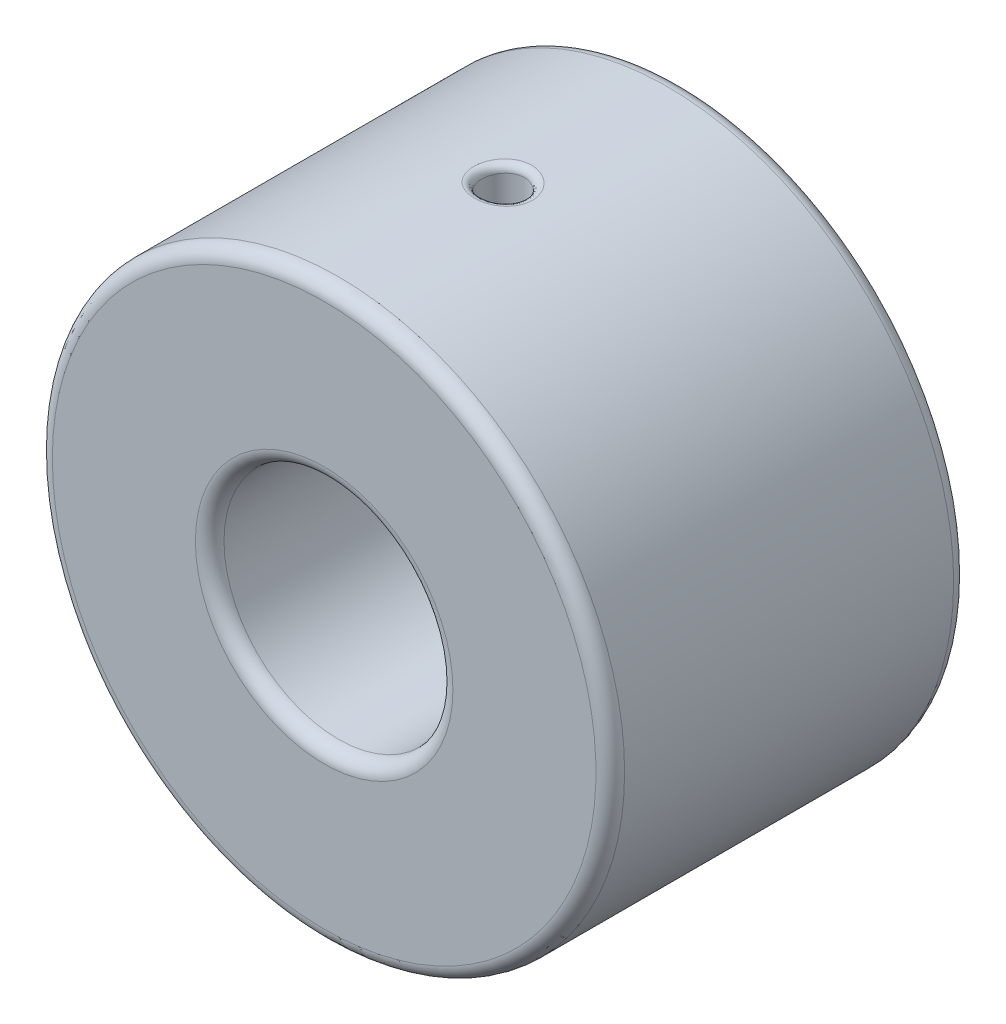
from build123d import *

# Parameters (mm, degrees)
SKETCH_1_W          = 12.5
SKETCH_1_H          = 6
FILLET_1_R          = 0.5
SKETCH_2_R          = 0.75
CUT_EXTRUDE_1_DEPTH = 10
FILLET_2_R          = 0.25


with BuildPart() as part:
    # Sketch 1 → Revolve 1 (revolve)
    with BuildSketch(Plane(origin=(0, 0, 0), x_dir=(0, 0, -1), z_dir=(1, 0, 0)), mode=Mode.PRIVATE) as revolve_1_sk:
        with Locations((0, 7)):
            Rectangle(SKETCH_1_W, SKETCH_1_H)
    revolve(revolve_1_sk.sketch.rotate(Axis((0, 0, 6.25), (0, 0, -1)), 90), axis=Axis((0, 0, 6.25), (0, 0, -1)))

    # Fillet 1
    fillet_1_edges = [part.edges().sort_by_distance(p)[0] for p in [
        (-10, 0, 6.25),
        (-10, 0, -6.25),
        (-4, 0, -6.25),
        (-4, 0, 6.25),
    ]]
    fillet(fillet_1_edges, radius=FILLET_1_R)

    # Sketch 2 → Cut-Extrude 1 (cut, symmetric)
    with BuildSketch(Plane(origin=(0, 0, 0), x_dir=(1, 0, 0), z_dir=(0, 1, 0))):
        with Locations(Location((0, 0, 0), (0, 0, 270))):
            Circle(SKETCH_2_R)
    extrude(amount=CUT_EXTRUDE_1_DEPTH, both=True, mode=Mode.SUBTRACT)

    # Fillet 2
    fillet_2_edges = [part.edges().sort_by_distance(p)[0] for p in [
        (0, 10, -0.75),
        (0, -10, -0.75),
        (0, -4.000000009, -0.74999999),
        (0, 4.000000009, -0.74999999),
    ]]
    fillet(fillet_2_edges, radius=FILLET_2_R)


solid = part.part
